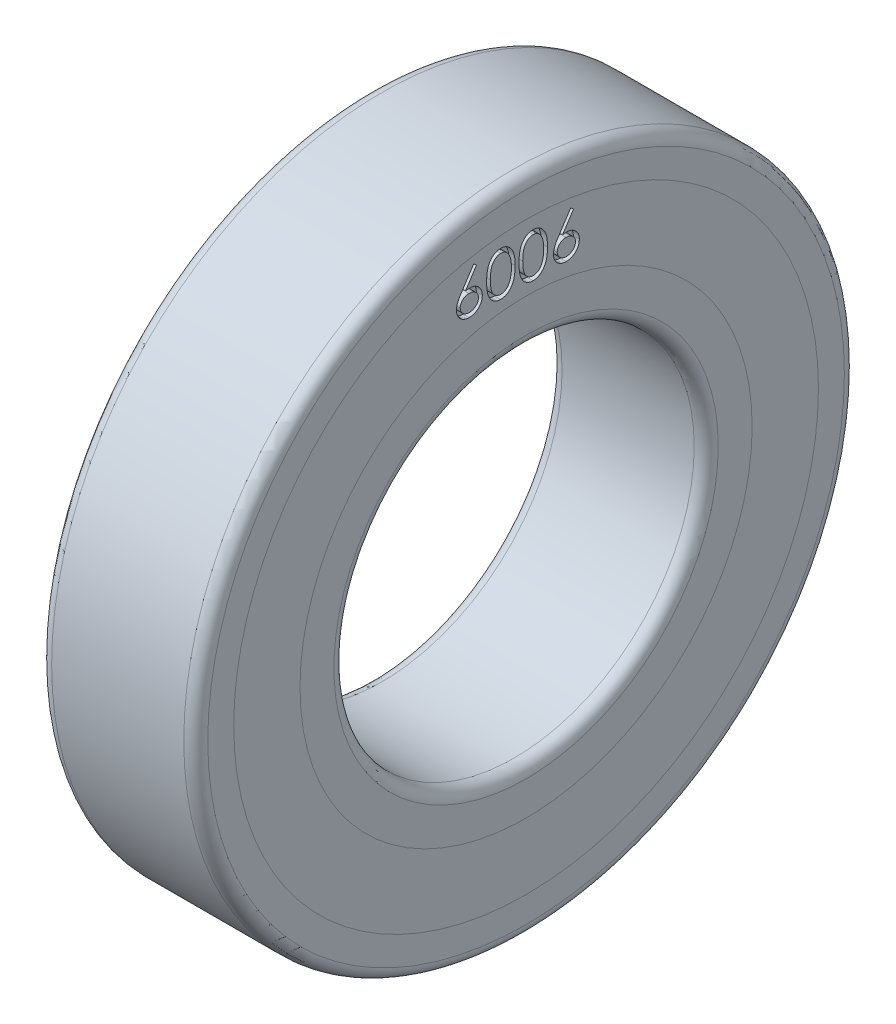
from build123d import *

# Parameters (mm, degrees)
SKETCH1_R           = 27.5
SKETCH1_R_2         = 15
BOSS_EXTRUDE1_DEPTH = 13
FILLET1_R           = 1
CUT_EXTRUDE1_DEPTH  = 0.5


with BuildPart() as part:
    # Sketch1 → Boss-Extrude1 (new body)
    with BuildSketch(Plane(origin=(0, 0, 0), x_dir=(0, 0, -1), z_dir=(1, 0, 0))):
        with Locations(Location((0, 0, 0), (0, 0, 180))):
            Circle(SKETCH1_R)
        with Locations(Location((0, 0, 0), (0, 0, 180))):
            Circle(SKETCH1_R_2, mode=Mode.SUBTRACT)
    extrude(amount=BOSS_EXTRUDE1_DEPTH)

    # Fillet1
    fillet1_edges = [part.edges().sort_by_distance(p)[0] for p in [
        (0, 0, -27.5),
        (13, 0, -27.5),
        (0, 0, -15),
        (13, 0, -15),
    ]]
    fillet(fillet1_edges, radius=FILLET1_R)

    # Sketch3 → Cut-Extrude1 (cut)
    # profile 1 of 4: a face of its own
    with BuildSketch(Plane(origin=(13, 0, 0), x_dir=(0, 0, -1), z_dir=(1, 0, 0))):
        with BuildLine():
            Line((-4.361983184, 23.314780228), (-4.120096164, 23.124776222))
            Line((-4.120096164, 23.124776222), (-5.044875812, 21.710613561))
            add(Edge.make_bspline(
                [(-5.044875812, 21.710613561), (-4.983305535, 21.720427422), (-4.863205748, 21.739570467), (-4.74163985, 21.742728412), (-4.682395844, 21.744267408)],
                knots=[0, 0, 0, 0, 1.025318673, 2, 2, 2, 2], degree=3))
            add(Edge.make_bspline(
                [(-4.682395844, 21.744267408), (-4.646823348, 21.743311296), (-4.576799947, 21.741429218), (-4.473993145, 21.726945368), (-4.375204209, 21.704120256), (-4.280842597, 21.670848), (-4.190569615, 21.628345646), (-4.103867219, 21.577406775), (-4.022365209, 21.515401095), (-3.945014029, 21.446136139), (-3.874786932, 21.369419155), (-3.812610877, 21.288017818), (-3.760384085, 21.202016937), (-3.718010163, 21.111460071), (-3.685105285, 21.016486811), (-3.66111764, 20.917218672), (-3.646938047, 20.813587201), (-3.645012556, 20.743109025), (-3.644034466, 20.707308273)],
                knots=[0, 0, 0, 0, 1.04369286, 2.054478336, 3.041073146, 4.015093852, 4.984733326, 5.965804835, 6.960378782, 7.985147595, 9.009457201, 10.008161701, 10.986880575, 11.956520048, 12.937015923, 13.931873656, 14.949455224, 16, 16, 16, 16], degree=3))
            add(Edge.make_bspline(
                [(-3.644034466, 20.707308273), (-3.645457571, 20.658328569), (-3.648257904, 20.561948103), (-3.6761617, 20.421571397), (-3.719521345, 20.287838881), (-3.781498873, 20.16288571), (-3.858481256, 20.04688314), (-3.952358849, 19.944097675), (-4.059802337, 19.852427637), (-4.181289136, 19.775771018), (-4.3120321, 19.713167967), (-4.449384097, 19.668202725), (-4.592011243, 19.640519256), (-4.688815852, 19.637048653), (-4.737784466, 19.635293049)],
                knots=[0, 0, 0, 0, 1.031375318, 2.029502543, 3.004789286, 3.987476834, 4.960371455, 5.9300674, 6.912260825, 7.929083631, 8.949397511, 9.960523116, 10.96833055, 12, 12, 12, 12], degree=3))
            add(Edge.make_bspline(
                [(-4.737784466, 19.635293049), (-4.784881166, 19.636821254), (-4.878171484, 19.639848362), (-5.015404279, 19.6668143), (-5.147267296, 19.710521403), (-5.272836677, 19.770735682), (-5.38915729, 19.846793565), (-5.493222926, 19.938355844), (-5.584514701, 20.043465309), (-5.660489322, 20.162105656), (-5.720748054, 20.289595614), (-5.765937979, 20.42253277), (-5.792334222, 20.560432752), (-5.796022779, 20.653913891), (-5.79788062, 20.700998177)],
                knots=[0, 0, 0, 0, 1.012016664, 2.004627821, 2.994792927, 3.992885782, 4.990978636, 5.973936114, 6.964471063, 7.975201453, 8.993600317, 9.990122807, 10.98767138, 12, 12, 12, 12], degree=3))
            add(Edge.make_bspline(
                [(-5.79788062, 20.700998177), (-5.796699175, 20.73704276), (-5.79428689, 20.810638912), (-5.777443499, 20.92210294), (-5.750378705, 21.036154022), (-5.720068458, 21.132908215), (-5.688042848, 21.212169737), (-5.661390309, 21.276073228), (-5.628216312, 21.341834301), (-5.592842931, 21.411707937), (-5.552086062, 21.48389337), (-5.507770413, 21.559597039), (-5.458670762, 21.637614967), (-5.424250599, 21.690559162), (-5.406654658, 21.717624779)],
                knots=[0, 0, 0, 0, 1.173818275, 2.396712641, 3.66331629, 4.989737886, 5.693666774, 6.447286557, 7.243889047, 8.091586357, 8.998013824, 9.943181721, 10.948533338, 12, 12, 12, 12], degree=3))
            Line((-5.406654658, 21.717624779), (-4.361983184, 23.314780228))
        make_face()
        with BuildLine():
            add(Edge.make_bspline(
                [(-4.748301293, 21.385293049), (-4.774963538, 21.384515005), (-4.827042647, 21.38299526), (-4.903450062, 21.374170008), (-4.975763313, 21.357550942), (-5.044940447, 21.33638461), (-5.10968815, 21.30728155), (-5.17047699, 21.271929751), (-5.227542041, 21.230308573), (-5.280285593, 21.183007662), (-5.328105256, 21.131219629), (-5.369286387, 21.075750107), (-5.404808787, 21.017935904), (-5.433690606, 20.957293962), (-5.456180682, 20.893847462), (-5.472448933, 20.827888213), (-5.481502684, 20.758973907), (-5.483008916, 20.712241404), (-5.483778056, 20.688377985)],
                knots=[0, 0, 0, 0, 1.129588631, 2.206414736, 3.251139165, 4.268635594, 5.265702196, 6.250456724, 7.242448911, 8.251968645, 9.246821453, 10.222880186, 11.173611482, 12.116736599, 13.062300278, 14.020270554, 14.989073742, 16, 16, 16, 16], degree=3))
            add(Edge.make_bspline(
                [(-5.483778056, 20.688377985), (-5.483151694, 20.664728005), (-5.481923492, 20.618353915), (-5.470771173, 20.550014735), (-5.45373609, 20.484249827), (-5.428395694, 20.421398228), (-5.398168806, 20.36050191), (-5.358263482, 20.303766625), (-5.314046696, 20.247746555), (-5.261192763, 20.196745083), (-5.2044694, 20.149288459), (-5.143868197, 20.107808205), (-5.080708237, 20.072322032), (-5.014136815, 20.044510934), (-4.945098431, 20.021686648), (-4.873017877, 20.005625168), (-4.797845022, 19.996544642), (-4.746923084, 19.995036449), (-4.720957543, 19.994267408)],
                knots=[0, 0, 0, 0, 0.989467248, 1.94019797, 2.891935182, 3.827694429, 4.772920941, 5.730924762, 6.725747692, 7.756678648, 8.79901574, 9.819492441, 10.826891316, 11.826466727, 12.835195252, 13.867842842, 14.912794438, 16, 16, 16, 16], degree=3))
            add(Edge.make_bspline(
                [(-4.720957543, 19.994267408), (-4.694992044, 19.995036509), (-4.64407019, 19.996544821), (-4.568896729, 20.00562449), (-4.496818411, 20.021689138), (-4.427771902, 20.044501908), (-4.361230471, 20.072355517), (-4.29812575, 20.107587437), (-4.238097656, 20.149543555), (-4.181337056, 20.196663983), (-4.128703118, 20.248036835), (-4.083425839, 20.303266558), (-4.044742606, 20.360960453), (-4.013308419, 20.421158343), (-3.988247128, 20.48428783), (-3.97112566, 20.550004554), (-3.959996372, 20.61835658), (-3.958765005, 20.664728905), (-3.95813703, 20.688377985)],
                knots=[0, 0, 0, 0, 1.087397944, 2.132534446, 3.165364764, 4.174271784, 5.174024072, 6.181601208, 7.194203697, 8.236725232, 9.267838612, 10.269026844, 11.221737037, 12.171628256, 13.107553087, 14.05945871, 15.010357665, 16, 16, 16, 16], degree=3))
            add(Edge.make_bspline(
                [(-3.95813703, 20.688377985), (-3.958687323, 20.712272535), (-3.959767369, 20.759169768), (-3.971983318, 20.827857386), (-3.988925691, 20.894182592), (-4.014508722, 20.957728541), (-4.047745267, 21.018244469), (-4.088228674, 21.07603607), (-4.135061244, 21.131546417), (-4.189158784, 21.183109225), (-4.248049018, 21.230256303), (-4.310664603, 21.27187586), (-4.376172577, 21.307000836), (-4.444506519, 21.336307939), (-4.516449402, 21.357457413), (-4.590839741, 21.374110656), (-4.668628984, 21.382972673), (-4.721405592, 21.384509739), (-4.748301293, 21.385293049)],
                knots=[0, 0, 0, 0, 0.978206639, 1.919901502, 2.851605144, 3.780102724, 4.718870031, 5.675451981, 6.667674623, 7.690630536, 8.733308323, 9.756129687, 10.767539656, 11.776269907, 12.797430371, 13.836405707, 14.897401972, 16, 16, 16, 16], degree=3))
        make_face(mode=Mode.SUBTRACT)
    # profile 2 of 4: a face of its own
    with BuildSketch(Plane(origin=(13, 0, 0), x_dir=(0, 0, -1), z_dir=(1, 0, 0))):
        with BuildLine():
            add(Edge.make_bspline(
                [(-3.285060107, 21.473634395), (-3.284732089, 21.529731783), (-3.284094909, 21.638701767), (-3.277006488, 21.797486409), (-3.265231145, 21.946446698), (-3.249093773, 22.085589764), (-3.229455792, 22.214951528), (-3.203240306, 22.334186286), (-3.173427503, 22.443845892), (-3.138875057, 22.544287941), (-3.099887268, 22.636865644), (-3.057453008, 22.723290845), (-3.009888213, 22.803432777), (-2.9599113, 22.878570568), (-2.905499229, 22.947474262), (-2.848200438, 23.011116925), (-2.785778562, 23.068027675), (-2.720355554, 23.119873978), (-2.651339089, 23.16532345), (-2.580696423, 23.205356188), (-2.507941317, 23.239556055), (-2.432875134, 23.266446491), (-2.356172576, 23.288657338), (-2.27756551, 23.303846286), (-2.196924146, 23.313403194), (-2.142492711, 23.314316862), (-2.114887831, 23.314780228)],
                knots=[0, 0, 0, 0, 1.646270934, 3.197905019, 4.663502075, 6.030701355, 7.308322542, 8.50163776, 9.611534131, 10.641858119, 11.616356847, 12.558055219, 13.465016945, 14.349605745, 15.204443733, 16.039544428, 16.859896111, 17.680448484, 18.487036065, 19.28249412, 20.06191084, 20.843045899, 21.620316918, 22.403196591, 23.190181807, 24, 24, 24, 24], degree=3))
            add(Edge.make_bspline(
                [(-2.114887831, 23.314780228), (-2.087052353, 23.314292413), (-2.031696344, 23.313322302), (-1.949855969, 23.30399836), (-1.869906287, 23.288527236), (-1.792188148, 23.266606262), (-1.716063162, 23.239410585), (-1.642126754, 23.205323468), (-1.569919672, 23.165644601), (-1.500589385, 23.119020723), (-1.433374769, 23.067038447), (-1.369926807, 23.008275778), (-1.310239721, 22.943326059), (-1.253564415, 22.872884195), (-1.201508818, 22.79559911), (-1.151935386, 22.712815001), (-1.10756335, 22.623084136), (-1.064828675, 22.527903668), (-1.027941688, 22.424640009), (-0.994675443, 22.313875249), (-0.967796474, 22.194301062), (-0.945407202, 22.066544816), (-0.928062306, 21.930137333), (-0.915429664, 21.785371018), (-0.908756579, 21.632150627), (-0.907499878, 21.527392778), (-0.906854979, 21.473634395)],
                knots=[0, 0, 0, 0, 0.810914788, 1.612654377, 2.396697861, 3.181598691, 3.963628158, 4.749916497, 5.551656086, 6.361998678, 7.18212741, 8.025565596, 8.878627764, 9.750805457, 10.657531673, 11.591944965, 12.560506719, 13.57287815, 14.630710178, 15.753379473, 16.941251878, 18.199788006, 19.531962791, 20.947069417, 22.433333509, 24, 24, 24, 24], degree=3))
            add(Edge.make_bspline(
                [(-0.906854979, 21.473634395), (-0.907506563, 21.420110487), (-0.908776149, 21.315821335), (-0.915354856, 21.16329036), (-0.928313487, 21.019292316), (-0.944523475, 20.883481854), (-0.966974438, 20.756424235), (-0.994579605, 20.637679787), (-1.025229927, 20.526735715), (-1.063064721, 20.424500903), (-1.104475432, 20.32954918), (-1.149530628, 20.240882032), (-1.197800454, 20.157715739), (-1.250389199, 20.080715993), (-1.306442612, 20.009337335), (-1.367160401, 19.944839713), (-1.430830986, 19.885669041), (-1.498243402, 19.833017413), (-1.568654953, 19.786932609), (-1.64061403, 19.745718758), (-1.715397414, 19.712486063), (-1.791310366, 19.683951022), (-1.869438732, 19.66215057), (-1.949685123, 19.647076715), (-2.031641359, 19.636504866), (-2.087042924, 19.635698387), (-2.114887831, 19.635293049)],
                knots=[0, 0, 0, 0, 1.561518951, 3.042555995, 4.452378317, 5.7783523, 7.031515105, 8.214008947, 9.334062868, 10.386615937, 11.391082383, 12.354592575, 13.286541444, 14.194233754, 15.072674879, 15.931287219, 16.775624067, 17.606195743, 18.42308326, 19.229000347, 20.022332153, 20.807536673, 21.593273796, 22.3848459, 23.188221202, 24, 24, 24, 24], degree=3))
            add(Edge.make_bspline(
                [(-2.114887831, 19.635293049), (-2.142491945, 19.635759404), (-2.19692187, 19.636678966), (-2.277574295, 19.646192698), (-2.355856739, 19.661488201), (-2.432155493, 19.682904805), (-2.506862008, 19.709119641), (-2.578958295, 19.743273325), (-2.649245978, 19.782607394), (-2.717537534, 19.827402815), (-2.782549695, 19.878724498), (-2.844648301, 19.935488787), (-2.90227332, 19.999112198), (-2.955907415, 20.068590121), (-3.006881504, 20.143283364), (-3.053770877, 20.224211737), (-3.097141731, 20.311054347), (-3.136785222, 20.404372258), (-3.171933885, 20.505527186), (-3.202981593, 20.615676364), (-3.227495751, 20.735792), (-3.248478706, 20.864909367), (-3.265403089, 21.003583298), (-3.276957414, 21.151889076), (-3.284098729, 21.309734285), (-3.2847338, 21.418004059), (-3.285060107, 21.473634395)],
                knots=[0, 0, 0, 0, 0.810891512, 1.598919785, 2.382837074, 3.152667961, 3.926044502, 4.706494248, 5.493654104, 6.291793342, 7.103789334, 7.925228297, 8.761435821, 9.622817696, 10.50288917, 11.416980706, 12.369136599, 13.353924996, 14.394355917, 15.514179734, 16.714354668, 17.994756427, 19.357759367, 20.818452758, 22.365282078, 24, 24, 24, 24], degree=3))
        make_face()
        with BuildLine():
            add(Edge.make_bspline(
                [(-2.970957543, 21.475036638), (-2.970838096, 21.42828794), (-2.970606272, 21.337557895), (-2.964550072, 21.205714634), (-2.95629984, 21.082744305), (-2.945658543, 20.968490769), (-2.929855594, 20.863340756), (-2.912148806, 20.766571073), (-2.890600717, 20.678693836), (-2.865105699, 20.599106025), (-2.836066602, 20.526456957), (-2.804360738, 20.458855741), (-2.770300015, 20.395503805), (-2.732180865, 20.336970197), (-2.690665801, 20.283064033), (-2.646692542, 20.2328312), (-2.598619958, 20.188034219), (-2.532116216, 20.134307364), (-2.444319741, 20.07878823), (-2.333699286, 20.03044214), (-2.220030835, 20.000059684), (-2.142879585, 19.996195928), (-2.104371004, 19.994267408)],
                knots=[0, 0, 0, 0, 1.459021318, 2.831673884, 4.118529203, 5.306027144, 6.411944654, 7.436330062, 8.375795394, 9.233974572, 10.042671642, 10.816086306, 11.563610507, 12.285937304, 12.993564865, 13.685989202, 14.367179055, 15.041617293, 16.353048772, 17.594441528, 18.799311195, 20, 20, 20, 20], degree=3))
            add(Edge.make_bspline(
                [(-2.104371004, 19.994267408), (-2.065613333, 19.995865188), (-1.988178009, 19.999057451), (-1.875044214, 20.029856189), (-1.765213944, 20.076325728), (-1.679142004, 20.131273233), (-1.61365946, 20.183601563), (-1.56674247, 20.228216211), (-1.523680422, 20.278172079), (-1.482838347, 20.332071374), (-1.445379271, 20.390943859), (-1.411316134, 20.454506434), (-1.380232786, 20.522935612), (-1.36252374, 20.570705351), (-1.353469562, 20.595128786)],
                knots=[0, 0, 0, 0, 1.353760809, 2.704726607, 4.075137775, 5.516104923, 6.260822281, 7.007110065, 7.778089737, 8.566572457, 9.372053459, 10.217411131, 11.088608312, 12, 12, 12, 12], degree=3))
            add(Edge.make_bspline(
                [(-1.353469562, 20.595128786), (-1.342917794, 20.626358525), (-1.32149318, 20.68976829), (-1.293881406, 20.788131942), (-1.272136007, 20.891334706), (-1.252572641, 20.998759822), (-1.239219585, 21.111199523), (-1.228471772, 21.228305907), (-1.222141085, 21.350167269), (-1.221356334, 21.432962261), (-1.220957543, 21.475036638)],
                knots=[0, 0, 0, 0, 0.884706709, 1.796334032, 2.740027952, 3.714592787, 4.726048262, 5.777819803, 6.87074269, 8, 8, 8, 8], degree=3))
            add(Edge.make_bspline(
                [(-1.220957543, 21.475036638), (-1.221507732, 21.517104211), (-1.22258402, 21.599397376), (-1.226698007, 21.719915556), (-1.237321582, 21.834383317), (-1.249120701, 21.94329379), (-1.266517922, 22.046044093), (-1.285275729, 22.143494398), (-1.310476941, 22.234437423), (-1.337396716, 22.320297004), (-1.368207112, 22.400097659), (-1.402122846, 22.474211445), (-1.438344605, 22.54299617), (-1.477686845, 22.606263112), (-1.519682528, 22.664295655), (-1.565440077, 22.715930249), (-1.61314445, 22.762767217), (-1.679961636, 22.816229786), (-1.767435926, 22.870741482), (-1.876281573, 22.920907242), (-1.989552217, 22.949715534), (-2.066125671, 22.953777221), (-2.104371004, 22.955805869)],
                knots=[0, 0, 0, 0, 1.31362396, 2.569729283, 3.763502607, 4.902122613, 5.988968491, 7.01645872, 7.998833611, 8.933434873, 9.825090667, 10.667526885, 11.477055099, 12.250526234, 12.991942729, 13.710640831, 14.402115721, 15.076753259, 16.378508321, 17.609869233, 18.806226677, 20, 20, 20, 20], degree=3))
            add(Edge.make_bspline(
                [(-2.104371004, 22.955805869), (-2.143081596, 22.953774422), (-2.220573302, 22.949707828), (-2.335021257, 22.921014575), (-2.444725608, 22.871001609), (-2.531968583, 22.816049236), (-2.598832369, 22.763710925), (-2.645915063, 22.718324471), (-2.690061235, 22.668678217), (-2.730728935, 22.614276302), (-2.768818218, 22.555810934), (-2.803799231, 22.49282217), (-2.835316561, 22.424990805), (-2.864401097, 22.35237437), (-2.889973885, 22.272793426), (-2.911067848, 22.185024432), (-2.930554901, 22.08856254), (-2.94435017, 21.982843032), (-2.956613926, 21.868560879), (-2.964495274, 21.745283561), (-2.970626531, 21.61321918), (-2.970844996, 21.522020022), (-2.970957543, 21.475036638)],
                knots=[0, 0, 0, 0, 1.207732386, 2.417664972, 3.655092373, 4.956220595, 5.625982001, 6.301752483, 6.994047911, 7.697131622, 8.419323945, 9.170223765, 9.943494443, 10.752040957, 11.610060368, 12.549350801, 13.567764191, 14.679664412, 15.874934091, 17.154273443, 18.533957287, 20, 20, 20, 20], degree=3))
        make_face(mode=Mode.SUBTRACT)
    # profile 3 of 4: a face of its own
    with BuildSketch(Plane(origin=(13, 0, 0), x_dir=(0, 0, -1), z_dir=(1, 0, 0))):
        with BuildLine():
            add(Edge.make_bspline(
                [(-0.592752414, 21.473634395), (-0.592424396, 21.529731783), (-0.591787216, 21.638701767), (-0.584698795, 21.797486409), (-0.572923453, 21.946446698), (-0.55678608, 22.085589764), (-0.5371481, 22.214951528), (-0.510932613, 22.334186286), (-0.481119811, 22.443845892), (-0.446567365, 22.544287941), (-0.407579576, 22.636865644), (-0.365145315, 22.723290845), (-0.317580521, 22.803432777), (-0.267603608, 22.878570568), (-0.213191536, 22.947474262), (-0.155892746, 23.011116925), (-0.09347087, 23.068027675), (-0.028047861, 23.119873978), (0.040968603, 23.16532345), (0.111611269, 23.205356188), (0.184366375, 23.239556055), (0.259432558, 23.266446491), (0.336135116, 23.288657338), (0.414742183, 23.303846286), (0.495383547, 23.313403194), (0.549814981, 23.314316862), (0.577419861, 23.314780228)],
                knots=[0, 0, 0, 0, 1.646270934, 3.197905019, 4.663502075, 6.030701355, 7.308322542, 8.50163776, 9.611534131, 10.641858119, 11.616356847, 12.558055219, 13.465016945, 14.349605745, 15.204443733, 16.039544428, 16.859896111, 17.680448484, 18.487036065, 19.28249412, 20.06191084, 20.843045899, 21.620316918, 22.403196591, 23.190181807, 24, 24, 24, 24], degree=3))
            add(Edge.make_bspline(
                [(0.577419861, 23.314780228), (0.60525534, 23.314292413), (0.660611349, 23.313322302), (0.742451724, 23.30399836), (0.822401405, 23.288527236), (0.900119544, 23.266606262), (0.976244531, 23.239410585), (1.050180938, 23.205323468), (1.12238802, 23.165644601), (1.191718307, 23.119020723), (1.258932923, 23.067038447), (1.322380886, 23.008275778), (1.382067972, 22.943326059), (1.438743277, 22.872884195), (1.490798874, 22.79559911), (1.540372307, 22.712815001), (1.584744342, 22.623084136), (1.627479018, 22.527903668), (1.664366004, 22.424640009), (1.69763225, 22.313875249), (1.724511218, 22.194301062), (1.746900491, 22.066544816), (1.764245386, 21.930137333), (1.776878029, 21.785371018), (1.783551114, 21.632150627), (1.784807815, 21.527392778), (1.785452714, 21.473634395)],
                knots=[0, 0, 0, 0, 0.810914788, 1.612654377, 2.396697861, 3.181598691, 3.963628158, 4.749916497, 5.551656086, 6.361998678, 7.18212741, 8.025565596, 8.878627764, 9.750805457, 10.657531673, 11.591944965, 12.560506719, 13.57287815, 14.630710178, 15.753379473, 16.941251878, 18.199788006, 19.531962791, 20.947069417, 22.433333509, 24, 24, 24, 24], degree=3))
            add(Edge.make_bspline(
                [(1.785452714, 21.473634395), (1.784801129, 21.420110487), (1.783531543, 21.315821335), (1.776952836, 21.16329036), (1.763994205, 21.019292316), (1.747784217, 20.883481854), (1.725333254, 20.756424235), (1.697728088, 20.637679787), (1.667077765, 20.526735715), (1.629242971, 20.424500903), (1.58783226, 20.32954918), (1.542777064, 20.240882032), (1.494507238, 20.157715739), (1.441918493, 20.080715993), (1.38586508, 20.009337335), (1.325147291, 19.944839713), (1.261476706, 19.885669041), (1.19406429, 19.833017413), (1.123652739, 19.786932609), (1.051693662, 19.745718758), (0.976910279, 19.712486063), (0.900997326, 19.683951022), (0.82286896, 19.66215057), (0.742622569, 19.647076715), (0.660666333, 19.636504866), (0.605264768, 19.635698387), (0.577419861, 19.635293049)],
                knots=[0, 0, 0, 0, 1.561518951, 3.042555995, 4.452378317, 5.7783523, 7.031515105, 8.214008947, 9.334062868, 10.386615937, 11.391082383, 12.354592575, 13.286541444, 14.194233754, 15.072674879, 15.931287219, 16.775624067, 17.606195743, 18.42308326, 19.229000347, 20.022332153, 20.807536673, 21.593273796, 22.3848459, 23.188221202, 24, 24, 24, 24], degree=3))
            add(Edge.make_bspline(
                [(0.577419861, 19.635293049), (0.549815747, 19.635759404), (0.495385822, 19.636678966), (0.414733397, 19.646192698), (0.336450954, 19.661488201), (0.260152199, 19.682904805), (0.185445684, 19.709119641), (0.113349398, 19.743273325), (0.043061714, 19.782607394), (-0.025229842, 19.827402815), (-0.090242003, 19.878724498), (-0.152340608, 19.935488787), (-0.209965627, 19.999112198), (-0.263599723, 20.068590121), (-0.314573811, 20.143283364), (-0.361463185, 20.224211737), (-0.404834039, 20.311054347), (-0.444477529, 20.404372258), (-0.479626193, 20.505527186), (-0.510673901, 20.615676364), (-0.535188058, 20.735792), (-0.556171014, 20.864909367), (-0.573095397, 21.003583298), (-0.584649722, 21.151889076), (-0.591791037, 21.309734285), (-0.592426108, 21.418004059), (-0.592752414, 21.473634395)],
                knots=[0, 0, 0, 0, 0.810891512, 1.598919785, 2.382837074, 3.152667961, 3.926044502, 4.706494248, 5.493654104, 6.291793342, 7.103789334, 7.925228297, 8.761435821, 9.622817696, 10.50288917, 11.416980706, 12.369136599, 13.353924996, 14.394355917, 15.514179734, 16.714354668, 17.994756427, 19.357759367, 20.818452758, 22.365282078, 24, 24, 24, 24], degree=3))
        make_face()
        with BuildLine():
            add(Edge.make_bspline(
                [(-0.27864985, 21.475036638), (-0.278530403, 21.42828794), (-0.27829858, 21.337557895), (-0.272242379, 21.205714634), (-0.263992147, 21.082744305), (-0.25335085, 20.968490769), (-0.237547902, 20.863340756), (-0.219841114, 20.766571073), (-0.198293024, 20.678693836), (-0.172798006, 20.599106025), (-0.14375891, 20.526456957), (-0.112053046, 20.458855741), (-0.077992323, 20.395503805), (-0.039873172, 20.336970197), (0.001641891, 20.283064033), (0.04561515, 20.2328312), (0.093687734, 20.188034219), (0.160191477, 20.134307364), (0.247987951, 20.07878823), (0.358608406, 20.03044214), (0.472276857, 20.000059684), (0.549428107, 19.996195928), (0.587936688, 19.994267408)],
                knots=[0, 0, 0, 0, 1.459021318, 2.831673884, 4.118529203, 5.306027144, 6.411944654, 7.436330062, 8.375795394, 9.233974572, 10.042671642, 10.816086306, 11.563610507, 12.285937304, 12.993564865, 13.685989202, 14.367179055, 15.041617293, 16.353048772, 17.594441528, 18.799311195, 20, 20, 20, 20], degree=3))
            add(Edge.make_bspline(
                [(0.587936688, 19.994267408), (0.62669436, 19.995865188), (0.704129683, 19.999057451), (0.817263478, 20.029856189), (0.927093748, 20.076325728), (1.013165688, 20.131273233), (1.078648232, 20.183601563), (1.125565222, 20.228216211), (1.16862727, 20.278172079), (1.209469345, 20.332071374), (1.246928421, 20.390943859), (1.280991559, 20.454506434), (1.312074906, 20.522935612), (1.329783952, 20.570705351), (1.33883813, 20.595128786)],
                knots=[0, 0, 0, 0, 1.353760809, 2.704726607, 4.075137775, 5.516104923, 6.260822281, 7.007110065, 7.778089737, 8.566572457, 9.372053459, 10.217411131, 11.088608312, 12, 12, 12, 12], degree=3))
            add(Edge.make_bspline(
                [(1.33883813, 20.595128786), (1.349389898, 20.626358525), (1.370814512, 20.68976829), (1.398426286, 20.788131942), (1.420171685, 20.891334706), (1.439735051, 20.998759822), (1.453088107, 21.111199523), (1.46383592, 21.228305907), (1.470166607, 21.350167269), (1.470951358, 21.432962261), (1.47135015, 21.475036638)],
                knots=[0, 0, 0, 0, 0.884706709, 1.796334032, 2.740027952, 3.714592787, 4.726048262, 5.777819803, 6.87074269, 8, 8, 8, 8], degree=3))
            add(Edge.make_bspline(
                [(1.47135015, 21.475036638), (1.47079996, 21.517104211), (1.469723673, 21.599397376), (1.465609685, 21.719915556), (1.45498611, 21.834383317), (1.443186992, 21.94329379), (1.42578977, 22.046044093), (1.407031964, 22.143494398), (1.381830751, 22.234437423), (1.354910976, 22.320297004), (1.324100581, 22.400097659), (1.290184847, 22.474211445), (1.253963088, 22.54299617), (1.214620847, 22.606263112), (1.172625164, 22.664295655), (1.126867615, 22.715930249), (1.079163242, 22.762767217), (1.012346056, 22.816229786), (0.924871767, 22.870741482), (0.816026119, 22.920907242), (0.702755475, 22.949715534), (0.626182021, 22.953777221), (0.587936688, 22.955805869)],
                knots=[0, 0, 0, 0, 1.31362396, 2.569729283, 3.763502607, 4.902122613, 5.988968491, 7.01645872, 7.998833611, 8.933434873, 9.825090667, 10.667526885, 11.477055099, 12.250526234, 12.991942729, 13.710640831, 14.402115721, 15.076753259, 16.378508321, 17.609869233, 18.806226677, 20, 20, 20, 20], degree=3))
            add(Edge.make_bspline(
                [(0.587936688, 22.955805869), (0.549226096, 22.953774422), (0.47173439, 22.949707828), (0.357286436, 22.921014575), (0.247582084, 22.871001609), (0.160339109, 22.816049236), (0.093475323, 22.763710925), (0.046392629, 22.718324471), (0.002246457, 22.668678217), (-0.038421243, 22.614276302), (-0.076510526, 22.555810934), (-0.111491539, 22.49282217), (-0.143008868, 22.424990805), (-0.172093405, 22.35237437), (-0.197666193, 22.272793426), (-0.218760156, 22.185024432), (-0.238247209, 22.08856254), (-0.252042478, 21.982843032), (-0.264306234, 21.868560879), (-0.272187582, 21.745283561), (-0.278318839, 21.61321918), (-0.278537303, 21.522020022), (-0.27864985, 21.475036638)],
                knots=[0, 0, 0, 0, 1.207732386, 2.417664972, 3.655092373, 4.956220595, 5.625982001, 6.301752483, 6.994047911, 7.697131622, 8.419323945, 9.170223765, 9.943494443, 10.752040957, 11.610060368, 12.549350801, 13.567764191, 14.679664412, 15.874934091, 17.154273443, 18.533957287, 20, 20, 20, 20], degree=3))
        make_face(mode=Mode.SUBTRACT)
    # profile 4 of 4: a face of its own
    with BuildSketch(Plane(origin=(13, 0, 0), x_dir=(0, 0, -1), z_dir=(1, 0, 0))):
        with BuildLine():
            Line((3.714939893, 23.314780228), (3.956826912, 23.124776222))
            Line((3.956826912, 23.124776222), (3.032047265, 21.710613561))
            add(Edge.make_bspline(
                [(3.032047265, 21.710613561), (3.093617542, 21.720427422), (3.213717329, 21.739570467), (3.335283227, 21.742728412), (3.394527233, 21.744267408)],
                knots=[0, 0, 0, 0, 1.025318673, 2, 2, 2, 2], degree=3))
            add(Edge.make_bspline(
                [(3.394527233, 21.744267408), (3.430099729, 21.743311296), (3.50012313, 21.741429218), (3.602929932, 21.726945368), (3.701718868, 21.704120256), (3.79608048, 21.670848), (3.886353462, 21.628345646), (3.973055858, 21.577406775), (4.054557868, 21.515401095), (4.131909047, 21.446136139), (4.202136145, 21.369419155), (4.2643122, 21.288017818), (4.316538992, 21.202016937), (4.358912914, 21.111460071), (4.391817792, 21.016486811), (4.415805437, 20.917218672), (4.42998503, 20.813587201), (4.431910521, 20.743109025), (4.432888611, 20.707308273)],
                knots=[0, 0, 0, 0, 1.04369286, 2.054478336, 3.041073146, 4.015093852, 4.984733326, 5.965804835, 6.960378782, 7.985147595, 9.009457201, 10.008161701, 10.986880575, 11.956520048, 12.937015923, 13.931873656, 14.949455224, 16, 16, 16, 16], degree=3))
            add(Edge.make_bspline(
                [(4.432888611, 20.707308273), (4.431465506, 20.658328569), (4.428665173, 20.561948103), (4.400761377, 20.421571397), (4.357401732, 20.287838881), (4.295424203, 20.16288571), (4.21844182, 20.04688314), (4.124564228, 19.944097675), (4.017120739, 19.852427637), (3.895633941, 19.775771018), (3.764890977, 19.713167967), (3.62753898, 19.668202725), (3.484911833, 19.640519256), (3.388107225, 19.637048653), (3.339138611, 19.635293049)],
                knots=[0, 0, 0, 0, 1.031375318, 2.029502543, 3.004789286, 3.987476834, 4.960371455, 5.9300674, 6.912260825, 7.929083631, 8.949397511, 9.960523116, 10.96833055, 12, 12, 12, 12], degree=3))
            add(Edge.make_bspline(
                [(3.339138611, 19.635293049), (3.29204191, 19.636821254), (3.198751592, 19.639848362), (3.061518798, 19.6668143), (2.929655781, 19.710521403), (2.8040864, 19.770735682), (2.687765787, 19.846793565), (2.583700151, 19.938355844), (2.492408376, 20.043465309), (2.416433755, 20.162105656), (2.356175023, 20.289595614), (2.310985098, 20.42253277), (2.284588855, 20.560432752), (2.280900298, 20.653913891), (2.279042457, 20.700998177)],
                knots=[0, 0, 0, 0, 1.012016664, 2.004627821, 2.994792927, 3.992885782, 4.990978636, 5.973936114, 6.964471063, 7.975201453, 8.993600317, 9.990122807, 10.98767138, 12, 12, 12, 12], degree=3))
            add(Edge.make_bspline(
                [(2.279042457, 20.700998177), (2.280223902, 20.73704276), (2.282636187, 20.810638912), (2.299479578, 20.92210294), (2.326544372, 21.036154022), (2.356854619, 21.132908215), (2.388880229, 21.212169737), (2.415532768, 21.276073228), (2.448706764, 21.341834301), (2.484080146, 21.411707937), (2.524837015, 21.48389337), (2.569152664, 21.559597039), (2.618252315, 21.637614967), (2.652672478, 21.690559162), (2.670268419, 21.717624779)],
                knots=[0, 0, 0, 0, 1.173818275, 2.396712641, 3.66331629, 4.989737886, 5.693666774, 6.447286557, 7.243889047, 8.091586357, 8.998013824, 9.943181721, 10.948533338, 12, 12, 12, 12], degree=3))
            Line((2.670268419, 21.717624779), (3.714939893, 23.314780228))
        make_face()
        with BuildLine():
            add(Edge.make_bspline(
                [(3.328621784, 21.385293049), (3.301959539, 21.384515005), (3.24988043, 21.38299526), (3.173473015, 21.374170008), (3.101159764, 21.357550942), (3.03198263, 21.33638461), (2.967234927, 21.30728155), (2.906446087, 21.271929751), (2.849381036, 21.230308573), (2.796637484, 21.183007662), (2.74881782, 21.131219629), (2.70763669, 21.075750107), (2.67211429, 21.017935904), (2.643232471, 20.957293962), (2.620742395, 20.893847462), (2.604474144, 20.827888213), (2.595420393, 20.758973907), (2.593914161, 20.712241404), (2.593145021, 20.688377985)],
                knots=[0, 0, 0, 0, 1.129588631, 2.206414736, 3.251139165, 4.268635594, 5.265702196, 6.250456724, 7.242448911, 8.251968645, 9.246821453, 10.222880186, 11.173611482, 12.116736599, 13.062300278, 14.020270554, 14.989073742, 16, 16, 16, 16], degree=3))
            add(Edge.make_bspline(
                [(2.593145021, 20.688377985), (2.593771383, 20.664728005), (2.594999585, 20.618353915), (2.606151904, 20.550014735), (2.623186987, 20.484249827), (2.648527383, 20.421398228), (2.678754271, 20.36050191), (2.718659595, 20.303766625), (2.762876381, 20.247746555), (2.815730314, 20.196745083), (2.872453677, 20.149288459), (2.93305488, 20.107808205), (2.99621484, 20.072322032), (3.062786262, 20.044510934), (3.131824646, 20.021686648), (3.2039052, 20.005625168), (3.279078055, 19.996544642), (3.329999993, 19.995036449), (3.355965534, 19.994267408)],
                knots=[0, 0, 0, 0, 0.989467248, 1.94019797, 2.891935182, 3.827694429, 4.772920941, 5.730924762, 6.725747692, 7.756678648, 8.79901574, 9.819492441, 10.826891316, 11.826466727, 12.835195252, 13.867842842, 14.912794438, 16, 16, 16, 16], degree=3))
            add(Edge.make_bspline(
                [(3.355965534, 19.994267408), (3.381931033, 19.995036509), (3.432852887, 19.996544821), (3.508026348, 20.00562449), (3.580104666, 20.021689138), (3.649151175, 20.044501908), (3.715692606, 20.072355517), (3.778797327, 20.107587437), (3.838825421, 20.149543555), (3.89558602, 20.196663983), (3.948219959, 20.248036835), (3.993497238, 20.303266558), (4.032180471, 20.360960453), (4.063614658, 20.421158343), (4.088675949, 20.48428783), (4.105797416, 20.550004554), (4.116926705, 20.61835658), (4.118158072, 20.664728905), (4.118786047, 20.688377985)],
                knots=[0, 0, 0, 0, 1.087397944, 2.132534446, 3.165364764, 4.174271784, 5.174024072, 6.181601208, 7.194203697, 8.236725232, 9.267838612, 10.269026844, 11.221737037, 12.171628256, 13.107553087, 14.05945871, 15.010357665, 16, 16, 16, 16], degree=3))
            add(Edge.make_bspline(
                [(4.118786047, 20.688377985), (4.118235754, 20.712272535), (4.117155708, 20.759169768), (4.104939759, 20.827857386), (4.087997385, 20.894182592), (4.062414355, 20.957728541), (4.02917781, 21.018244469), (3.988694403, 21.07603607), (3.941861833, 21.131546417), (3.887764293, 21.183109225), (3.828874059, 21.230256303), (3.766258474, 21.27187586), (3.7007505, 21.307000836), (3.632416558, 21.336307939), (3.560473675, 21.357457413), (3.486083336, 21.374110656), (3.408294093, 21.382972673), (3.355517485, 21.384509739), (3.328621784, 21.385293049)],
                knots=[0, 0, 0, 0, 0.978206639, 1.919901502, 2.851605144, 3.780102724, 4.718870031, 5.675451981, 6.667674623, 7.690630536, 8.733308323, 9.756129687, 10.767539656, 11.776269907, 12.797430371, 13.836405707, 14.897401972, 16, 16, 16, 16], degree=3))
        make_face(mode=Mode.SUBTRACT)
    extrude(amount=-CUT_EXTRUDE1_DEPTH, mode=Mode.SUBTRACT)


solid = part.part
